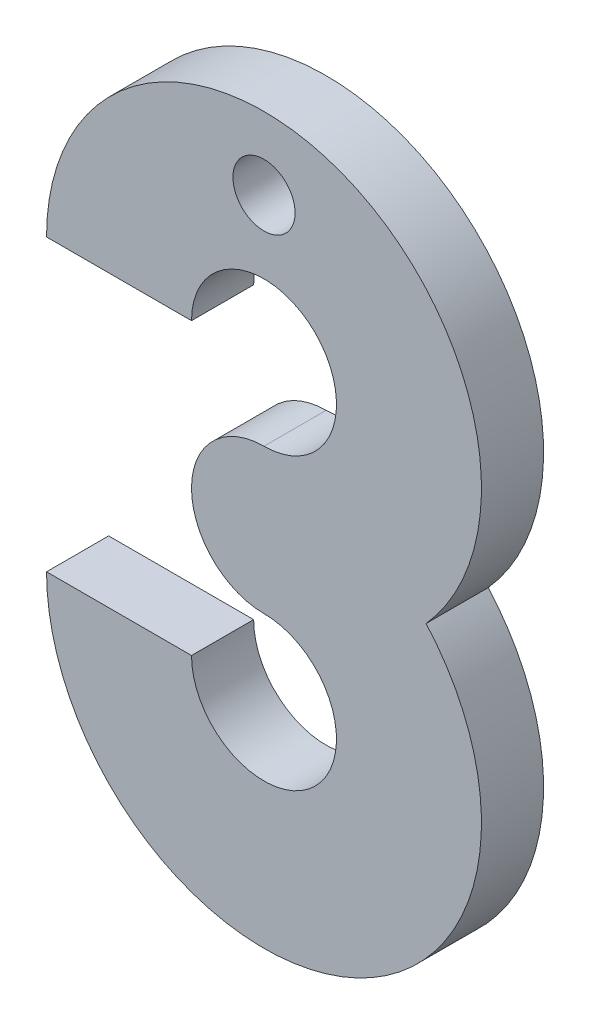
from build123d import *

# Parameters (mm, degrees)
SKETCH1_R      = 3
EXTRUDE1_DEPTH = 6


with BuildPart() as part:
    # Sketch1 → Extrude1 (new body)
    with BuildSketch(Plane.XY):
        with BuildLine():
            Line((14, 21), (0, 21))
            ThreePointArc((0, 21), (28.493263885, 1.382380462), (36.652475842, 35))
            ThreePointArc((36.652475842, 35), (28.493263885, 68.617619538), (0, 49))
            Line((0, 49), (14, 49))
            ThreePointArc((14, 49), (25.949747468, 53.949747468), (21, 42))
            ThreePointArc((21, 42), (14, 35), (21, 28))
            ThreePointArc((21, 28), (25.949747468, 16.050252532), (14, 21))
        make_face()
        with Locations((21, 63)):
            Circle(SKETCH1_R, mode=Mode.SUBTRACT)
    extrude(amount=EXTRUDE1_DEPTH)


solid = part.part
